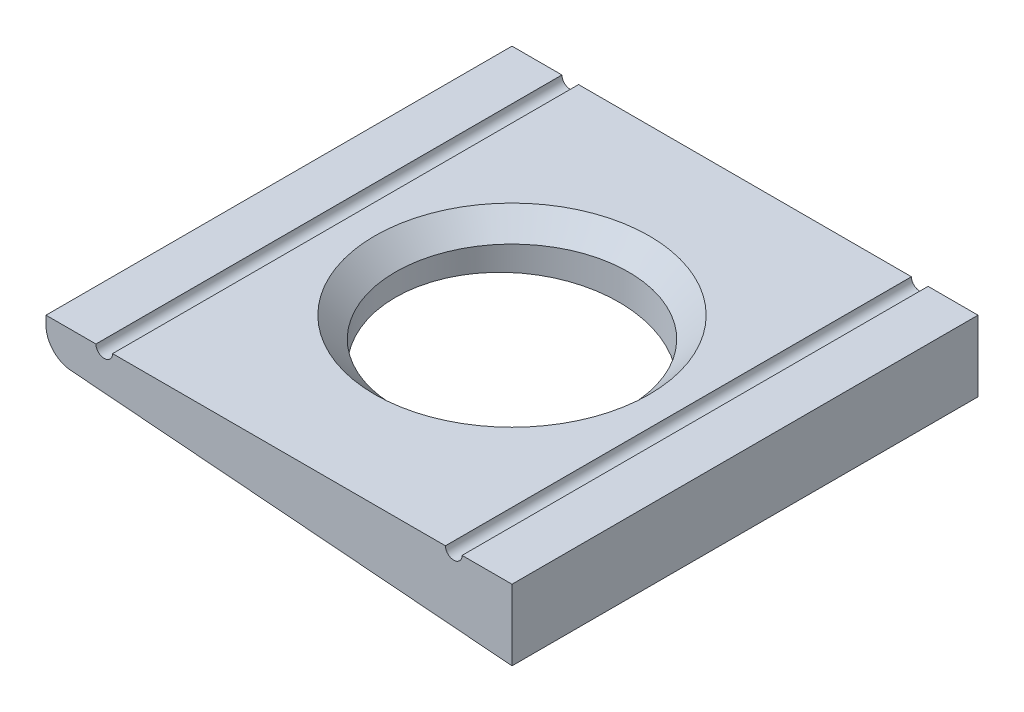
ISO-10303-21;
HEADER;
FILE_DESCRIPTION(('STEP AP214'),'2;1');
FILE_NAME('part.step','',(''),(''),'','','');
FILE_SCHEMA(('AUTOMOTIVE_DESIGN { 1 0 10303 214 1 1 1 1 }'));
ENDSEC;
DATA;
#1=APPLICATION_CONTEXT('core data for automotive mechanical design processes');
#2=APPLICATION_PROTOCOL_DEFINITION('international standard','automotive_design',2000,#1);
#3=PRODUCT_CONTEXT('',#1,'mechanical');
#4=PRODUCT('Part','Part','',(#3));
#5=PRODUCT_RELATED_PRODUCT_CATEGORY('part','',(#4));
#6=PRODUCT_DEFINITION_FORMATION('','',#4);
#7=PRODUCT_DEFINITION_CONTEXT('part definition',#1,'design');
#8=PRODUCT_DEFINITION('design','',#6,#7);
#9=PRODUCT_DEFINITION_SHAPE('','',#8);
#10=(LENGTH_UNIT() NAMED_UNIT(*) SI_UNIT(.MILLI.,.METRE.));
#11=(NAMED_UNIT(*) PLANE_ANGLE_UNIT() SI_UNIT($,.RADIAN.));
#12=(NAMED_UNIT(*) SI_UNIT($,.STERADIAN.) SOLID_ANGLE_UNIT());
#13=UNCERTAINTY_MEASURE_WITH_UNIT(LENGTH_MEASURE(1.E-05),#10,'distance_accuracy_value','');
#14=(GEOMETRIC_REPRESENTATION_CONTEXT(3) GLOBAL_UNCERTAINTY_ASSIGNED_CONTEXT((#13)) GLOBAL_UNIT_ASSIGNED_CONTEXT((#10,
#11,#12)) REPRESENTATION_CONTEXT('',''));
#15=CARTESIAN_POINT('',(0.,0.,0.));
#16=DIRECTION('',(0.,0.,1.));
#17=DIRECTION('',(1.,0.,0.));
#18=AXIS2_PLACEMENT_3D('',#15,#16,#17);
#19=CARTESIAN_POINT('',(28.,0.,28.));
#20=DIRECTION('',(0.,-1.,0.));
#21=DIRECTION('',(1.,0.,0.));
#22=AXIS2_PLACEMENT_3D('',#19,#20,#21);
#23=PLANE('',#22);
#24=CARTESIAN_POINT('',(0.,0.,0.));
#25=DIRECTION('',(0.,-1.,0.));
#26=DIRECTION('',(1.,0.,0.));
#27=AXIS2_PLACEMENT_3D('',#24,#25,#26);
#28=CIRCLE('',#27,16.5);
#29=CARTESIAN_POINT('',(16.5,0.,0.));
#30=VERTEX_POINT('',#29);
#31=EDGE_CURVE('E11',#30,#30,#28,.T.);
#32=ORIENTED_EDGE('',*,*,#31,.T.);
#33=EDGE_LOOP('',(#32));
#34=FACE_BOUND('',#33,.T.);
#35=DIRECTION('',(-1.,0.,0.));
#36=VECTOR('',#35,1.);
#37=CARTESIAN_POINT('',(28.,0.,-28.));
#38=LINE('',#37,#36);
#39=CARTESIAN_POINT('',(20.,0.,-28.));
#40=VERTEX_POINT('',#39);
#41=CARTESIAN_POINT('',(-20.,0.,-28.));
#42=VERTEX_POINT('',#41);
#43=EDGE_CURVE('E131',#40,#42,#38,.T.);
#44=ORIENTED_EDGE('',*,*,#43,.T.);
#45=DIRECTION('',(0.,0.,1.));
#46=VECTOR('',#45,1.);
#47=CARTESIAN_POINT('',(-20.,0.,-28.));
#48=LINE('',#47,#46);
#49=CARTESIAN_POINT('',(-20.,0.,28.));
#50=VERTEX_POINT('',#49);
#51=EDGE_CURVE('E54',#42,#50,#48,.T.);
#52=ORIENTED_EDGE('',*,*,#51,.T.);
#53=DIRECTION('',(-1.,0.,0.));
#54=VECTOR('',#53,1.);
#55=CARTESIAN_POINT('',(28.,0.,28.));
#56=LINE('',#55,#54);
#57=CARTESIAN_POINT('',(20.,0.,28.));
#58=VERTEX_POINT('',#57);
#59=EDGE_CURVE('E213',#58,#50,#56,.T.);
#60=ORIENTED_EDGE('',*,*,#59,.F.);
#61=DIRECTION('',(0.,0.,1.));
#62=VECTOR('',#61,1.);
#63=CARTESIAN_POINT('',(20.,0.,-28.));
#64=LINE('',#63,#62);
#65=EDGE_CURVE('E247',#58,#40,#64,.F.);
#66=ORIENTED_EDGE('',*,*,#65,.T.);
#67=EDGE_LOOP('',(#44,#52,#60,#66));
#68=FACE_BOUND('',#67,.T.);
#69=ADVANCED_FACE('F39',(#34,#68),#23,.F.);
#70=CARTESIAN_POINT('',(28.,0.,-28.));
#71=VERTEX_POINT('',#70);
#72=CARTESIAN_POINT('',(22.,0.,-28.));
#73=VERTEX_POINT('',#72);
#74=EDGE_CURVE('E134',#71,#73,#38,.T.);
#75=ORIENTED_EDGE('',*,*,#74,.T.);
#76=DIRECTION('',(0.,0.,1.));
#77=VECTOR('',#76,1.);
#78=CARTESIAN_POINT('',(22.,0.,-28.));
#79=LINE('',#78,#77);
#80=CARTESIAN_POINT('',(22.,0.,28.));
#81=VERTEX_POINT('',#80);
#82=EDGE_CURVE('E62',#73,#81,#79,.T.);
#83=ORIENTED_EDGE('',*,*,#82,.T.);
#84=CARTESIAN_POINT('',(28.,0.,28.));
#85=VERTEX_POINT('',#84);
#86=EDGE_CURVE('E208',#85,#81,#56,.T.);
#87=ORIENTED_EDGE('',*,*,#86,.F.);
#88=DIRECTION('',(0.,0.,-1.));
#89=VECTOR('',#88,1.);
#90=CARTESIAN_POINT('',(28.,0.,28.));
#91=LINE('',#90,#89);
#92=EDGE_CURVE('E162',#85,#71,#91,.T.);
#93=ORIENTED_EDGE('',*,*,#92,.T.);
#94=EDGE_LOOP('',(#75,#83,#87,#93));
#95=FACE_BOUND('',#94,.T.);
#96=ADVANCED_FACE('F182',(#95),#23,.F.);
#97=CARTESIAN_POINT('',(28.,0.,28.));
#98=DIRECTION('',(-1.,0.,0.));
#99=DIRECTION('',(0.,-1.,0.));
#100=AXIS2_PLACEMENT_3D('',#97,#98,#99);
#101=PLANE('',#100);
#102=DIRECTION('',(0.,1.,0.));
#103=VECTOR('',#102,1.);
#104=CARTESIAN_POINT('',(28.,0.,-28.));
#105=LINE('',#104,#103);
#106=CARTESIAN_POINT('',(28.,-8.5,-28.));
#107=VERTEX_POINT('',#106);
#108=EDGE_CURVE('E132',#107,#71,#105,.T.);
#109=ORIENTED_EDGE('',*,*,#108,.T.);
#110=ORIENTED_EDGE('',*,*,#92,.F.);
#111=DIRECTION('',(0.,1.,0.));
#112=VECTOR('',#111,1.);
#113=CARTESIAN_POINT('',(28.,0.,28.));
#114=LINE('',#113,#112);
#115=CARTESIAN_POINT('',(28.,-8.5,28.));
#116=VERTEX_POINT('',#115);
#117=EDGE_CURVE('E150',#116,#85,#114,.T.);
#118=ORIENTED_EDGE('',*,*,#117,.F.);
#119=DIRECTION('',(0.,0.,-1.));
#120=VECTOR('',#119,1.);
#121=CARTESIAN_POINT('',(28.,-8.5,28.));
#122=LINE('',#121,#120);
#123=EDGE_CURVE('E151',#116,#107,#122,.T.);
#124=ORIENTED_EDGE('',*,*,#123,.T.);
#125=EDGE_LOOP('',(#109,#110,#118,#124));
#126=FACE_BOUND('',#125,.T.);
#127=ADVANCED_FACE('F188',(#126),#101,.F.);
#128=CARTESIAN_POINT('',(-22.,0.,28.));
#129=VERTEX_POINT('',#128);
#130=CARTESIAN_POINT('',(-28.,0.,28.));
#131=VERTEX_POINT('',#130);
#132=EDGE_CURVE('E124',#129,#131,#56,.T.);
#133=ORIENTED_EDGE('',*,*,#132,.F.);
#134=DIRECTION('',(0.,0.,1.));
#135=VECTOR('',#134,1.);
#136=CARTESIAN_POINT('',(-22.,0.,-28.));
#137=LINE('',#136,#135);
#138=CARTESIAN_POINT('',(-22.,0.,-28.));
#139=VERTEX_POINT('',#138);
#140=EDGE_CURVE('E110',#129,#139,#137,.F.);
#141=ORIENTED_EDGE('',*,*,#140,.T.);
#142=CARTESIAN_POINT('',(-28.,0.,-28.));
#143=VERTEX_POINT('',#142);
#144=EDGE_CURVE('E122',#139,#143,#38,.T.);
#145=ORIENTED_EDGE('',*,*,#144,.T.);
#146=DIRECTION('',(0.,0.,-1.));
#147=VECTOR('',#146,1.);
#148=CARTESIAN_POINT('',(-28.,0.,28.));
#149=LINE('',#148,#147);
#150=EDGE_CURVE('E160',#131,#143,#149,.T.);
#151=ORIENTED_EDGE('',*,*,#150,.F.);
#152=EDGE_LOOP('',(#133,#141,#145,#151));
#153=FACE_BOUND('',#152,.T.);
#154=ADVANCED_FACE('F120',(#153),#23,.F.);
#155=CARTESIAN_POINT('',(-28.,0.,28.));
#156=DIRECTION('',(1.,0.,0.));
#157=DIRECTION('',(0.,0.,-1.));
#158=AXIS2_PLACEMENT_3D('',#155,#156,#157);
#159=PLANE('',#158);
#160=DIRECTION('',(0.,-1.,0.));
#161=VECTOR('',#160,1.);
#162=CARTESIAN_POINT('',(-28.,0.,-28.));
#163=LINE('',#162,#161);
#164=CARTESIAN_POINT('',(-28.,-1.06577633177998,-28.));
#165=VERTEX_POINT('',#164);
#166=EDGE_CURVE('E130',#143,#165,#163,.T.);
#167=ORIENTED_EDGE('',*,*,#166,.T.);
#168=DIRECTION('',(0.,0.,-1.));
#169=VECTOR('',#168,1.);
#170=CARTESIAN_POINT('',(-28.,-1.06577633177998,28.));
#171=LINE('',#170,#169);
#172=CARTESIAN_POINT('',(-28.,-1.06577633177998,28.));
#173=VERTEX_POINT('',#172);
#174=EDGE_CURVE('E158',#173,#165,#171,.T.);
#175=ORIENTED_EDGE('',*,*,#174,.F.);
#176=DIRECTION('',(0.,-1.,0.));
#177=VECTOR('',#176,1.);
#178=CARTESIAN_POINT('',(-28.,0.,28.));
#179=LINE('',#178,#177);
#180=EDGE_CURVE('E212',#131,#173,#179,.T.);
#181=ORIENTED_EDGE('',*,*,#180,.F.);
#182=ORIENTED_EDGE('',*,*,#150,.T.);
#183=EDGE_LOOP('',(#167,#175,#181,#182));
#184=FACE_BOUND('',#183,.T.);
#185=ADVANCED_FACE('F192',(#184),#159,.F.);
#186=CARTESIAN_POINT('',(-24.8,-1.06577633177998,28.));
#187=DIRECTION('',(0.,0.,-1.));
#188=DIRECTION('',(-1.,0.,0.));
#189=AXIS2_PLACEMENT_3D('',#186,#187,#188);
#190=CYLINDRICAL_SURFACE('',#189,3.2);
#191=CARTESIAN_POINT('',(-24.8,-1.06577633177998,-28.));
#192=DIRECTION('',(0.,0.,1.));
#193=DIRECTION('',(-1.,0.,0.));
#194=AXIS2_PLACEMENT_3D('',#191,#192,#193);
#195=CIRCLE('',#194,3.2);
#196=CARTESIAN_POINT('',(-25.0551847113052,-4.25558522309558,-28.));
#197=VERTEX_POINT('',#196);
#198=EDGE_CURVE('E142',#165,#197,#195,.T.);
#199=ORIENTED_EDGE('',*,*,#198,.T.);
#200=DIRECTION('',(0.,0.,-1.));
#201=VECTOR('',#200,1.);
#202=CARTESIAN_POINT('',(-25.0551847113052,-4.25558522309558,28.));
#203=LINE('',#202,#201);
#204=CARTESIAN_POINT('',(-25.0551847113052,-4.25558522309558,28.));
#205=VERTEX_POINT('',#204);
#206=EDGE_CURVE('E154',#205,#197,#203,.T.);
#207=ORIENTED_EDGE('',*,*,#206,.F.);
#208=CARTESIAN_POINT('',(-24.8,-1.06577633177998,28.));
#209=DIRECTION('',(0.,0.,1.));
#210=DIRECTION('',(-1.,0.,0.));
#211=AXIS2_PLACEMENT_3D('',#208,#209,#210);
#212=CIRCLE('',#211,3.2);
#213=EDGE_CURVE('E223',#173,#205,#212,.T.);
#214=ORIENTED_EDGE('',*,*,#213,.F.);
#215=ORIENTED_EDGE('',*,*,#174,.T.);
#216=EDGE_LOOP('',(#199,#207,#214,#215));
#217=FACE_BOUND('',#216,.T.);
#218=ADVANCED_FACE('F197',(#217),#190,.T.);
#219=CARTESIAN_POINT('',(28.,-8.5,28.));
#220=DIRECTION('',(0.0797452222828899,0.996815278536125,0.));
#221=DIRECTION('',(-0.996815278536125,0.0797452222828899,0.));
#222=AXIS2_PLACEMENT_3D('',#219,#220,#221);
#223=PLANE('',#222);
#224=CARTESIAN_POINT('',(0.,-6.26,0.));
#225=DIRECTION('',(0.0797452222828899,0.996815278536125,0.));
#226=DIRECTION('',(-0.996815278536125,0.0797452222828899,0.));
#227=AXIS2_PLACEMENT_3D('',#224,#225,#226);
#228=ELLIPSE('',#227,14.0447285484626,14.);
#229=CARTESIAN_POINT('',(-14.,-5.14,0.));
#230=VERTEX_POINT('',#229);
#231=EDGE_CURVE('E136',#230,#230,#228,.T.);
#232=ORIENTED_EDGE('',*,*,#231,.T.);
#233=EDGE_LOOP('',(#232));
#234=FACE_BOUND('',#233,.T.);
#235=DIRECTION('',(0.996815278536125,-0.0797452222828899,0.));
#236=VECTOR('',#235,1.);
#237=CARTESIAN_POINT('',(28.,-8.5,-28.));
#238=LINE('',#237,#236);
#239=EDGE_CURVE('E146',#197,#107,#238,.T.);
#240=ORIENTED_EDGE('',*,*,#239,.T.);
#241=ORIENTED_EDGE('',*,*,#123,.F.);
#242=DIRECTION('',(0.996815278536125,-0.0797452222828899,0.));
#243=VECTOR('',#242,1.);
#244=CARTESIAN_POINT('',(28.,-8.5,28.));
#245=LINE('',#244,#243);
#246=EDGE_CURVE('E155',#205,#116,#245,.T.);
#247=ORIENTED_EDGE('',*,*,#246,.F.);
#248=ORIENTED_EDGE('',*,*,#206,.T.);
#249=EDGE_LOOP('',(#240,#241,#247,#248));
#250=FACE_BOUND('',#249,.T.);
#251=ADVANCED_FACE('F230',(#234,#250),#223,.F.);
#252=CARTESIAN_POINT('',(-24.8,-1.06577633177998,28.));
#253=DIRECTION('',(0.,0.,-1.));
#254=DIRECTION('',(-1.,0.,0.));
#255=AXIS2_PLACEMENT_3D('',#252,#253,#254);
#256=PLANE('',#255);
#257=ORIENTED_EDGE('',*,*,#59,.T.);
#258=CARTESIAN_POINT('',(-21.,0.,28.));
#259=DIRECTION('',(0.,0.,1.));
#260=DIRECTION('',(1.,0.,0.));
#261=AXIS2_PLACEMENT_3D('',#258,#259,#260);
#262=CIRCLE('',#261,1.);
#263=EDGE_CURVE('E125',#129,#50,#262,.T.);
#264=ORIENTED_EDGE('',*,*,#263,.F.);
#265=ORIENTED_EDGE('',*,*,#132,.T.);
#266=ORIENTED_EDGE('',*,*,#180,.T.);
#267=ORIENTED_EDGE('',*,*,#213,.T.);
#268=ORIENTED_EDGE('',*,*,#246,.T.);
#269=ORIENTED_EDGE('',*,*,#117,.T.);
#270=ORIENTED_EDGE('',*,*,#86,.T.);
#271=CARTESIAN_POINT('',(21.,0.,28.));
#272=DIRECTION('',(0.,0.,1.));
#273=DIRECTION('',(1.,0.,0.));
#274=AXIS2_PLACEMENT_3D('',#271,#272,#273);
#275=CIRCLE('',#274,1.);
#276=EDGE_CURVE('E249',#58,#81,#275,.T.);
#277=ORIENTED_EDGE('',*,*,#276,.F.);
#278=EDGE_LOOP('',(#257,#264,#265,#266,#267,#268,#269,#270,#277));
#279=FACE_BOUND('',#278,.T.);
#280=ADVANCED_FACE('F216',(#279),#256,.F.);
#281=CARTESIAN_POINT('',(-24.8,-1.06577633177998,-28.));
#282=DIRECTION('',(0.,0.,-1.));
#283=DIRECTION('',(-1.,0.,0.));
#284=AXIS2_PLACEMENT_3D('',#281,#282,#283);
#285=PLANE('',#284);
#286=CARTESIAN_POINT('',(-21.,0.,-28.));
#287=DIRECTION('',(0.,0.,-1.));
#288=DIRECTION('',(-1.,0.,0.));
#289=AXIS2_PLACEMENT_3D('',#286,#287,#288);
#290=CIRCLE('',#289,1.);
#291=EDGE_CURVE('E107',#42,#139,#290,.T.);
#292=ORIENTED_EDGE('',*,*,#291,.F.);
#293=ORIENTED_EDGE('',*,*,#43,.F.);
#294=CARTESIAN_POINT('',(21.,0.,-28.));
#295=DIRECTION('',(0.,0.,-1.));
#296=DIRECTION('',(-1.,0.,0.));
#297=AXIS2_PLACEMENT_3D('',#294,#295,#296);
#298=CIRCLE('',#297,1.);
#299=EDGE_CURVE('E116',#73,#40,#298,.T.);
#300=ORIENTED_EDGE('',*,*,#299,.F.);
#301=ORIENTED_EDGE('',*,*,#74,.F.);
#302=ORIENTED_EDGE('',*,*,#108,.F.);
#303=ORIENTED_EDGE('',*,*,#239,.F.);
#304=ORIENTED_EDGE('',*,*,#198,.F.);
#305=ORIENTED_EDGE('',*,*,#166,.F.);
#306=ORIENTED_EDGE('',*,*,#144,.F.);
#307=EDGE_LOOP('',(#292,#293,#300,#301,#302,#303,#304,#305,#306));
#308=FACE_BOUND('',#307,.T.);
#309=ADVANCED_FACE('F128',(#308),#285,.T.);
#310=CARTESIAN_POINT('',(0.,-8.5,0.));
#311=DIRECTION('',(0.,1.,0.));
#312=DIRECTION('',(-1.,0.,0.));
#313=AXIS2_PLACEMENT_3D('',#310,#311,#312);
#314=CYLINDRICAL_SURFACE('',#313,14.);
#315=CARTESIAN_POINT('',(0.,-2.5,0.));
#316=DIRECTION('',(0.,-1.,0.));
#317=DIRECTION('',(1.,0.,0.));
#318=AXIS2_PLACEMENT_3D('',#315,#316,#317);
#319=CIRCLE('',#318,14.);
#320=CARTESIAN_POINT('',(14.,-2.5,0.));
#321=VERTEX_POINT('',#320);
#322=EDGE_CURVE('E47',#321,#321,#319,.F.);
#323=ORIENTED_EDGE('',*,*,#322,.T.);
#324=EDGE_LOOP('',(#323));
#325=FACE_BOUND('',#324,.T.);
#326=ORIENTED_EDGE('',*,*,#231,.F.);
#327=EDGE_LOOP('',(#326));
#328=FACE_BOUND('',#327,.T.);
#329=ADVANCED_FACE('F169',(#325,#328),#314,.F.);
#330=CARTESIAN_POINT('',(21.,0.,-28.));
#331=DIRECTION('',(0.,0.,1.));
#332=DIRECTION('',(1.,0.,0.));
#333=AXIS2_PLACEMENT_3D('',#330,#331,#332);
#334=CYLINDRICAL_SURFACE('',#333,1.);
#335=ORIENTED_EDGE('',*,*,#299,.T.);
#336=ORIENTED_EDGE('',*,*,#65,.F.);
#337=ORIENTED_EDGE('',*,*,#276,.T.);
#338=ORIENTED_EDGE('',*,*,#82,.F.);
#339=EDGE_LOOP('',(#335,#336,#337,#338));
#340=FACE_BOUND('',#339,.T.);
#341=ADVANCED_FACE('F178',(#340),#334,.F.);
#342=CARTESIAN_POINT('',(-21.,0.,-28.));
#343=DIRECTION('',(0.,0.,1.));
#344=DIRECTION('',(1.,0.,0.));
#345=AXIS2_PLACEMENT_3D('',#342,#343,#344);
#346=CYLINDRICAL_SURFACE('',#345,1.);
#347=ORIENTED_EDGE('',*,*,#291,.T.);
#348=ORIENTED_EDGE('',*,*,#140,.F.);
#349=ORIENTED_EDGE('',*,*,#263,.T.);
#350=ORIENTED_EDGE('',*,*,#51,.F.);
#351=EDGE_LOOP('',(#347,#348,#349,#350));
#352=FACE_BOUND('',#351,.T.);
#353=ADVANCED_FACE('F109',(#352),#346,.F.);
#354=CARTESIAN_POINT('',(0.,-2.5,0.));
#355=DIRECTION('',(0.,1.,0.));
#356=DIRECTION('',(-1.,0.,0.));
#357=AXIS2_PLACEMENT_3D('',#354,#355,#356);
#358=CONICAL_SURFACE('',#357,14.,0.78539816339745);
#359=ORIENTED_EDGE('',*,*,#31,.F.);
#360=EDGE_LOOP('',(#359));
#361=FACE_BOUND('',#360,.T.);
#362=ORIENTED_EDGE('',*,*,#322,.F.);
#363=EDGE_LOOP('',(#362));
#364=FACE_BOUND('',#363,.T.);
#365=ADVANCED_FACE('F41',(#361,#364),#358,.F.);
#366=CLOSED_SHELL('',(#69,#96,#127,#154,#185,#218,#251,#280,#309,#329,#341,#353,#365));
#367=MANIFOLD_SOLID_BREP('B2',#366);
#368=ADVANCED_BREP_SHAPE_REPRESENTATION('',(#18,#367),#14);
#369=SHAPE_DEFINITION_REPRESENTATION(#9,#368);
ENDSEC;
END-ISO-10303-21;
